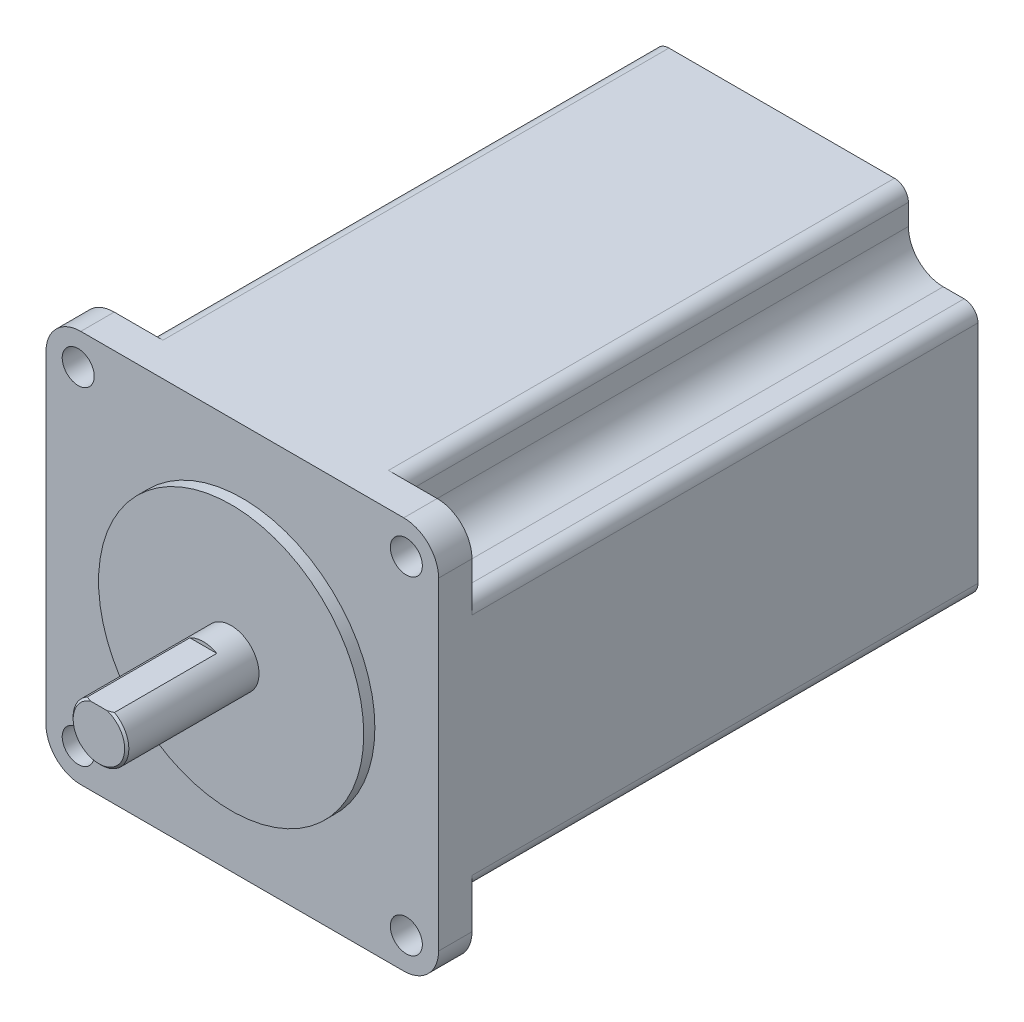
from build123d import *

# Parameters (mm, degrees)
SKETCH_1_R          = 19.05
EXTRUDE_1_DEPTH     = 1.6
SKETCH_2_R          = 4
EXTRUDE_2_DEPTH     = 19
CUT_EXTRUDE_START   = -15
CUT_EXTRUDE_1_DEPTH = 15
EXTRUDE_3_DEPTH     = 77.5
CUT_EXTRUDE_START_2 = -72.7
CUT_EXTRUDE_2_DEPTH = 72.7
SKETCH_6_R          = 2.3
CUT_EXTRUDE_3_DEPTH = 49.7
CHAMFER_1_SIZE      = 0.3


with BuildPart() as part:
    # Sketch 1 → Extrude 1 (new body)
    with BuildSketch(Plane.XY):
        Circle(SKETCH_1_R)
    extrude(amount=-EXTRUDE_1_DEPTH)

    # Sketch 2 → Extrude 2 (add)
    with BuildSketch(Plane.XY):
        Circle(SKETCH_2_R)
    extrude(amount=EXTRUDE_2_DEPTH)

    # Sketch 3 → Cut-Extrude 1 (cut)
    with BuildSketch(Plane.XY.offset(19).offset(CUT_EXTRUDE_START)):
        with BuildLine():
            Line((-1.936491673, 3.5), (1.936491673, 3.5))
            ThreePointArc((1.936491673, 3.5), (0, 4), (-1.936491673, 3.5))
        make_face()
    extrude(amount=CUT_EXTRUDE_1_DEPTH, mode=Mode.SUBTRACT)

    # Sketch 4 → Extrude 3 (add)
    with BuildSketch(Plane(origin=(0, 0, -1.6), x_dir=(-1, 0, 0), z_dir=(0, 0, -1))):
        with BuildLine():
            Line((0, 28.2), (23.2, 28.2))
            ThreePointArc((23.2, 28.2), (26.735533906, 26.735533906), (28.2, 23.2))
            Line((28.2, 23.2), (28.2, -23.2))
            ThreePointArc((28.2, -23.2), (26.735533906, -26.735533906), (23.2, -28.2))
            Line((23.2, -28.2), (-23.2, -28.2))
            ThreePointArc((-23.2, -28.2), (-26.735533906, -26.735533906), (-28.2, -23.2))
            Line((-28.2, -23.2), (-28.2, 23.2))
            ThreePointArc((-28.2, 23.2), (-26.735533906, 26.735533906), (-23.2, 28.2))
            Line((-23.2, 28.2), (0, 28.2))
        make_face()
    extrude(amount=EXTRUDE_3_DEPTH)

    # Sketch 5 → Cut-Extrude 2 (cut)
    with BuildSketch(Plane(origin=(0, 0, -79.1), x_dir=(-1, 0, 0), z_dir=(0, 0, -1)).offset(CUT_EXTRUDE_START_2)):
        with BuildLine():
            Line((11.494440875, 28.2), (16.2, 28.2))
            ThreePointArc((16.2, 28.2), (17.614213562, 27.614213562), (18.2, 26.2))
            Line((18.2, 26.2), (18.2, 23.2))
            ThreePointArc((18.2, 23.2), (19.664466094, 19.664466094), (23.2, 18.2))
            Line((23.2, 18.2), (26.2, 18.2))
            ThreePointArc((26.2, 18.2), (27.614213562, 17.614213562), (28.2, 16.2))
            Line((28.2, 16.2), (28.2, 9.920361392))
            Line((28.2, 9.920361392), (36.460073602, 9.920361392))
            Line((36.460073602, 9.920361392), (36.460073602, 32.177113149))
            Line((36.460073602, 32.177113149), (11.494440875, 32.177113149))
            Line((11.494440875, 32.177113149), (11.494440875, 28.2))
        make_face()
        with BuildLine():
            Line((-11.494440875, 32.177113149), (-11.494440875, 28.2))
            Line((-11.494440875, 28.2), (-16.2, 28.2))
            ThreePointArc((-16.2, 28.2), (-17.614213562, 27.614213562), (-18.2, 26.2))
            Line((-18.2, 26.2), (-18.2, 23.2))
            ThreePointArc((-18.2, 23.2), (-19.664466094, 19.664466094), (-23.2, 18.2))
            Line((-23.2, 18.2), (-26.2, 18.2))
            ThreePointArc((-26.2, 18.2), (-27.614213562, 17.614213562), (-28.2, 16.2))
            Line((-28.2, 16.2), (-28.2, 9.920361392))
            Line((-28.2, 9.920361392), (-36.460073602, 9.920361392))
            Line((-36.460073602, 9.920361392), (-36.460073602, 32.177113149))
            Line((-36.460073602, 32.177113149), (-11.494440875, 32.177113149))
        make_face()
        with BuildLine():
            Line((11.494440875, -32.177113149), (11.494440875, -28.2))
            Line((11.494440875, -28.2), (16.2, -28.2))
            ThreePointArc((16.2, -28.2), (17.614213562, -27.614213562), (18.2, -26.2))
            Line((18.2, -26.2), (18.2, -23.2))
            ThreePointArc((18.2, -23.2), (19.664466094, -19.664466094), (23.2, -18.2))
            Line((23.2, -18.2), (26.2, -18.2))
            ThreePointArc((26.2, -18.2), (27.614213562, -17.614213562), (28.2, -16.2))
            Line((28.2, -16.2), (28.2, -9.920361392))
            Line((28.2, -9.920361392), (36.460073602, -9.920361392))
            Line((36.460073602, -9.920361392), (36.460073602, -32.177113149))
            Line((36.460073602, -32.177113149), (11.494440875, -32.177113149))
        make_face()
        with BuildLine():
            Line((-11.494440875, -28.2), (-16.2, -28.2))
            ThreePointArc((-16.2, -28.2), (-17.614213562, -27.614213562), (-18.2, -26.2))
            Line((-18.2, -26.2), (-18.2, -23.2))
            ThreePointArc((-18.2, -23.2), (-19.664466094, -19.664466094), (-23.2, -18.2))
            Line((-23.2, -18.2), (-26.2, -18.2))
            ThreePointArc((-26.2, -18.2), (-27.614213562, -17.614213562), (-28.2, -16.2))
            Line((-28.2, -16.2), (-28.2, -9.920361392))
            Line((-28.2, -9.920361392), (-36.460073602, -9.920361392))
            Line((-36.460073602, -9.920361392), (-36.460073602, -32.177113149))
            Line((-36.460073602, -32.177113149), (-11.494440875, -32.177113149))
            Line((-11.494440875, -32.177113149), (-11.494440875, -28.2))
        make_face()
    extrude(amount=CUT_EXTRUDE_2_DEPTH, mode=Mode.SUBTRACT)

    # Sketch 6 → Cut-Extrude 3 (cut)
    with BuildSketch(Plane.XY.offset(-1.6)):
        with Locations((-23.57, 23.57)):
            Circle(SKETCH_6_R)
        with Locations((23.57, 23.57)):
            Circle(SKETCH_6_R)
        with Locations((23.57, -23.57)):
            Circle(SKETCH_6_R)
        with Locations((-23.57, -23.57)):
            Circle(SKETCH_6_R)
    extrude(amount=-CUT_EXTRUDE_3_DEPTH, mode=Mode.SUBTRACT)

    # Chamfer 1
    chamfer_1_edges = [part.edges().sort_by_distance(p)[0] for p in [
        (-2.031506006, -3.445719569, 19),
    ]]
    chamfer(chamfer_1_edges, length=CHAMFER_1_SIZE)


solid = part.part
